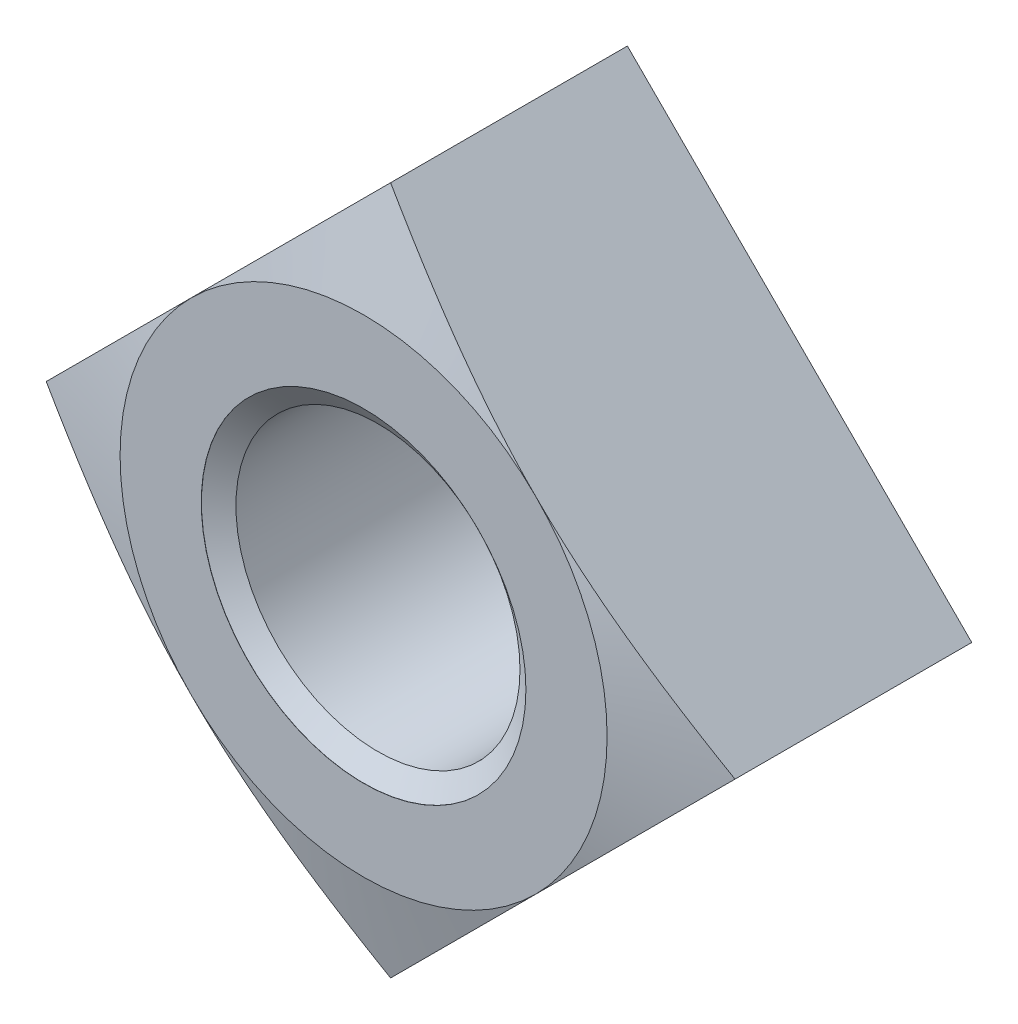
ISO-10303-21;
HEADER;
FILE_DESCRIPTION(('STEP AP214'),'2;1');
FILE_NAME('part.step','',(''),(''),'','','');
FILE_SCHEMA(('AUTOMOTIVE_DESIGN { 1 0 10303 214 1 1 1 1 }'));
ENDSEC;
DATA;
#1=APPLICATION_CONTEXT('core data for automotive mechanical design processes');
#2=APPLICATION_PROTOCOL_DEFINITION('international standard','automotive_design',2000,#1);
#3=PRODUCT_CONTEXT('',#1,'mechanical');
#4=PRODUCT('Part','Part','',(#3));
#5=PRODUCT_RELATED_PRODUCT_CATEGORY('part','',(#4));
#6=PRODUCT_DEFINITION_FORMATION('','',#4);
#7=PRODUCT_DEFINITION_CONTEXT('part definition',#1,'design');
#8=PRODUCT_DEFINITION('design','',#6,#7);
#9=PRODUCT_DEFINITION_SHAPE('','',#8);
#10=(LENGTH_UNIT() NAMED_UNIT(*) SI_UNIT(.MILLI.,.METRE.));
#11=(NAMED_UNIT(*) PLANE_ANGLE_UNIT() SI_UNIT($,.RADIAN.));
#12=(NAMED_UNIT(*) SI_UNIT($,.STERADIAN.) SOLID_ANGLE_UNIT());
#13=UNCERTAINTY_MEASURE_WITH_UNIT(LENGTH_MEASURE(1.E-05),#10,'distance_accuracy_value','');
#14=(GEOMETRIC_REPRESENTATION_CONTEXT(3) GLOBAL_UNCERTAINTY_ASSIGNED_CONTEXT((#13)) GLOBAL_UNIT_ASSIGNED_CONTEXT((#10,
#11,#12)) REPRESENTATION_CONTEXT('',''));
#15=CARTESIAN_POINT('',(0.,0.,0.));
#16=DIRECTION('',(0.,0.,1.));
#17=DIRECTION('',(1.,0.,0.));
#18=AXIS2_PLACEMENT_3D('',#15,#16,#17);
#19=CARTESIAN_POINT('',(0.,0.,-13.));
#20=DIRECTION('',(0.,0.,1.));
#21=DIRECTION('',(1.,0.,0.));
#22=AXIS2_PLACEMENT_3D('',#19,#20,#21);
#23=CYLINDRICAL_SURFACE('',#22,7.);
#24=CARTESIAN_POINT('',(0.,0.,-0.708207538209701));
#25=DIRECTION('',(0.,0.,1.));
#26=DIRECTION('',(1.,0.,0.));
#27=AXIS2_PLACEMENT_3D('',#24,#25,#26);
#28=CIRCLE('',#27,7.);
#29=CARTESIAN_POINT('',(7.,0.,-0.708207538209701));
#30=VERTEX_POINT('',#29);
#31=EDGE_CURVE('E183',#30,#30,#28,.F.);
#32=CARTESIAN_POINT('',(0.,0.,-12.2907924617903));
#33=DIRECTION('',(0.,0.,-1.));
#34=DIRECTION('',(-1.,0.,0.));
#35=AXIS2_PLACEMENT_3D('',#32,#33,#34);
#36=CIRCLE('',#35,7.);
#37=CARTESIAN_POINT('',(7.,0.,-12.2907924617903));
#38=VERTEX_POINT('',#37);
#39=EDGE_CURVE('E46',#38,#38,#36,.F.);
#40=CARTESIAN_POINT('',(7.,0.,-0.708207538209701));
#41=CARTESIAN_POINT('',(7.,0.,-0.828859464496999));
#42=CARTESIAN_POINT('',(7.,0.,-0.949511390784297));
#43=CARTESIAN_POINT('',(7.,0.,-1.19081524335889));
#44=CARTESIAN_POINT('',(7.,0.,-1.31146716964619));
#45=CARTESIAN_POINT('',(7.,0.,-1.55277102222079));
#46=CARTESIAN_POINT('',(7.,0.,-1.67342294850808));
#47=CARTESIAN_POINT('',(7.,0.,-1.91472680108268));
#48=CARTESIAN_POINT('',(7.,0.,-2.03537872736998));
#49=CARTESIAN_POINT('',(7.,0.,-2.27668257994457));
#50=CARTESIAN_POINT('',(7.,0.,-2.39733450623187));
#51=CARTESIAN_POINT('',(7.,0.,-2.63863835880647));
#52=CARTESIAN_POINT('',(7.,0.,-2.75929028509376));
#53=CARTESIAN_POINT('',(7.,0.,-3.00059413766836));
#54=CARTESIAN_POINT('',(7.,0.,-3.12124606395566));
#55=CARTESIAN_POINT('',(7.,0.,-3.36254991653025));
#56=CARTESIAN_POINT('',(7.,0.,-3.48320184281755));
#57=CARTESIAN_POINT('',(7.,0.,-3.72450569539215));
#58=CARTESIAN_POINT('',(7.,0.,-3.84515762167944));
#59=CARTESIAN_POINT('',(7.,0.,-4.08646147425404));
#60=CARTESIAN_POINT('',(7.,0.,-4.20711340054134));
#61=CARTESIAN_POINT('',(7.,0.,-4.44841725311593));
#62=CARTESIAN_POINT('',(7.,0.,-4.56906917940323));
#63=CARTESIAN_POINT('',(7.,0.,-4.81037303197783));
#64=CARTESIAN_POINT('',(7.,0.,-4.93102495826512));
#65=CARTESIAN_POINT('',(7.,0.,-5.17232881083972));
#66=CARTESIAN_POINT('',(7.,0.,-5.29298073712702));
#67=CARTESIAN_POINT('',(7.,0.,-5.53428458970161));
#68=CARTESIAN_POINT('',(7.,0.,-5.65493651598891));
#69=CARTESIAN_POINT('',(7.,0.,-5.89624036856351));
#70=CARTESIAN_POINT('',(7.,0.,-6.0168922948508));
#71=CARTESIAN_POINT('',(7.,0.,-6.2581961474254));
#72=CARTESIAN_POINT('',(7.,0.,-6.3788480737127));
#73=CARTESIAN_POINT('',(7.,0.,-6.62015192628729));
#74=CARTESIAN_POINT('',(7.,0.,-6.74080385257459));
#75=CARTESIAN_POINT('',(7.,0.,-6.98210770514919));
#76=CARTESIAN_POINT('',(7.,0.,-7.10275963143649));
#77=CARTESIAN_POINT('',(7.,0.,-7.34406348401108));
#78=CARTESIAN_POINT('',(7.,0.,-7.46471541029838));
#79=CARTESIAN_POINT('',(7.,0.,-7.70601926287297));
#80=CARTESIAN_POINT('',(7.,0.,-7.82667118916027));
#81=CARTESIAN_POINT('',(7.,0.,-8.06797504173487));
#82=CARTESIAN_POINT('',(7.,0.,-8.18862696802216));
#83=CARTESIAN_POINT('',(7.,0.,-8.42993082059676));
#84=CARTESIAN_POINT('',(7.,0.,-8.55058274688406));
#85=CARTESIAN_POINT('',(7.,0.,-8.79188659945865));
#86=CARTESIAN_POINT('',(7.,0.,-8.91253852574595));
#87=CARTESIAN_POINT('',(7.,0.,-9.15384237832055));
#88=CARTESIAN_POINT('',(7.,0.,-9.27449430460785));
#89=CARTESIAN_POINT('',(7.,0.,-9.51579815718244));
#90=CARTESIAN_POINT('',(7.,0.,-9.63645008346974));
#91=CARTESIAN_POINT('',(7.,0.,-9.87775393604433));
#92=CARTESIAN_POINT('',(7.,0.,-9.99840586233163));
#93=CARTESIAN_POINT('',(7.,0.,-10.2397097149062));
#94=CARTESIAN_POINT('',(7.,0.,-10.3603616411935));
#95=CARTESIAN_POINT('',(7.,0.,-10.6016654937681));
#96=CARTESIAN_POINT('',(7.,0.,-10.7223174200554));
#97=CARTESIAN_POINT('',(7.,0.,-10.96362127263));
#98=CARTESIAN_POINT('',(7.,0.,-11.0842731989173));
#99=CARTESIAN_POINT('',(7.,0.,-11.3255770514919));
#100=CARTESIAN_POINT('',(7.,0.,-11.4462289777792));
#101=CARTESIAN_POINT('',(7.,0.,-11.6875328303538));
#102=CARTESIAN_POINT('',(7.,0.,-11.8081847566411));
#103=CARTESIAN_POINT('',(7.,0.,-12.0494886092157));
#104=CARTESIAN_POINT('',(7.,0.,-12.170140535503));
#105=CARTESIAN_POINT('',(7.,0.,-12.2907924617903));
#106=B_SPLINE_CURVE_WITH_KNOTS('',3,(#40,#41,#42,#43,#44,#45,#46,#47,#48,#49,#50,#51,#52,#53,
#54,#55,#56,#57,#58,#59,#60,#61,#62,#63,#64,#65,#66,#67,#68,#69,#70,#71,#72,#73,#74,#75,#76,#77,
#78,#79,#80,#81,#82,#83,#84,#85,#86,#87,#88,#89,#90,#91,#92,#93,#94,#95,#96,#97,#98,#99,#100,
#101,#102,#103,#104,#105),.UNSPECIFIED.,.F.,.F.,(4,2,2,2,2,2,2,2,2,2,2,2,2,2,2,2,2,2,2,2,2,2,2,
2,2,2,2,2,2,2,2,2,4),(0.,0.361955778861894,0.723911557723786,1.08586733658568,1.44782311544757,
1.80977889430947,2.17173467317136,2.53369045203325,2.89564623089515,3.25760200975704,
3.61955778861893,3.98151356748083,4.34346934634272,4.70542512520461,5.06738090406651,
5.4293366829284,5.79129246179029,6.15324824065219,6.51520401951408,6.87715979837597,
7.23911557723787,7.60107135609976,7.96302713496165,8.32498291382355,8.68693869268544,
9.04889447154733,9.41085025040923,9.77280602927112,10.134761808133,10.4967175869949,
10.8586733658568,11.2206291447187,11.5825849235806),.UNSPECIFIED.);
#107=EDGE_CURVE('BSEAM41',#30,#38,#106,.T.);
#108=ORIENTED_EDGE('',*,*,#31,.F.);
#109=ORIENTED_EDGE('',*,*,#39,.F.);
#110=ORIENTED_EDGE('',*,*,#107,.T.);
#111=ORIENTED_EDGE('',*,*,#107,.F.);
#112=EDGE_LOOP('',(#108,#110,#109,#111));
#113=FACE_BOUND('',#112,.T.);
#114=ADVANCED_FACE('F41',(#113),#23,.F.);
#115=CARTESIAN_POINT('',(0.,-16.9705627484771,-13.));
#116=DIRECTION('',(0.707106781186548,-0.707106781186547,0.));
#117=DIRECTION('',(0.707106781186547,0.707106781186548,0.));
#118=AXIS2_PLACEMENT_3D('',#115,#116,#117);
#119=PLANE('',#118);
#120=DIRECTION('',(0.,0.,1.));
#121=VECTOR('',#120,1.);
#122=CARTESIAN_POINT('',(16.9705627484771,0.,-13.));
#123=LINE('',#122,#121);
#124=CARTESIAN_POINT('',(16.9705627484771,0.,-13.));
#125=VERTEX_POINT('',#124);
#126=CARTESIAN_POINT('',(16.9705627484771,0.,-1.33185827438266));
#127=VERTEX_POINT('',#126);
#128=EDGE_CURVE('E174',#125,#127,#123,.T.);
#129=ORIENTED_EDGE('',*,*,#128,.T.);
#130=CARTESIAN_POINT('',(16.9707627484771,0.000200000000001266,-1.33191186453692));
#131=CARTESIAN_POINT('',(16.7160871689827,-0.254475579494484,-1.26368267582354));
#132=CARTESIAN_POINT('',(16.4612127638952,-0.509349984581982,-1.19691326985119));
#133=CARTESIAN_POINT('',(15.9510162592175,-1.01954648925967,-1.0667933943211));
#134=CARTESIAN_POINT('',(15.6956941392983,-1.27486860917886,-1.00344308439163));
#135=CARTESIAN_POINT('',(15.1844078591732,-1.78615488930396,-0.880626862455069));
#136=CARTESIAN_POINT('',(14.9284433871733,-2.04211936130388,-0.821163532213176));
#137=CARTESIAN_POINT('',(14.4160134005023,-2.55454934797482,-0.706762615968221));
#138=CARTESIAN_POINT('',(14.1595478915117,-2.81101485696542,-0.651824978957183));
#139=CARTESIAN_POINT('',(13.3887812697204,-3.58178147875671,-0.494643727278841));
#140=CARTESIAN_POINT('',(12.8736681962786,-4.09689455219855,-0.400168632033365));
#141=CARTESIAN_POINT('',(11.841395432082,-5.1291673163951,-0.237805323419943));
#142=CARTESIAN_POINT('',(11.3242362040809,-5.64632654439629,-0.169911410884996));
#143=CARTESIAN_POINT('',(10.5512179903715,-6.4193447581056,-0.0926130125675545));
#144=CARTESIAN_POINT('',(10.2959571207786,-6.67460562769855,-0.0710120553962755));
#145=CARTESIAN_POINT('',(9.78514714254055,-7.18541560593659,-0.036117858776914));
#146=CARTESIAN_POINT('',(9.5295980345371,-7.44096471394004,-0.022824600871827));
#147=CARTESIAN_POINT('',(9.01834367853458,-7.95221906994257,-0.0048944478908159));
#148=CARTESIAN_POINT('',(8.76263842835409,-8.20792432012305,-0.000257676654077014));
#149=CARTESIAN_POINT('',(8.25122407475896,-8.71933867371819,0.000236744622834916));
#150=CARTESIAN_POINT('',(7.99551497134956,-8.97504777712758,-0.00390559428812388));
#151=CARTESIAN_POINT('',(7.48449927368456,-9.48606347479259,-0.0208514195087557));
#152=CARTESIAN_POINT('',(7.22919253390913,-9.74137021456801,-0.0336461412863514));
#153=CARTESIAN_POINT('',(6.71886010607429,-10.2517026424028,-0.0675520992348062));
#154=CARTESIAN_POINT('',(6.46383441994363,-10.5067283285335,-0.0886633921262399));
#155=CARTESIAN_POINT('',(5.69934239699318,-11.271220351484,-0.163734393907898));
#156=CARTESIAN_POINT('',(5.19043259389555,-11.7801301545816,-0.229432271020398));
#157=CARTESIAN_POINT('',(4.4868931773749,-12.4836695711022,-0.338449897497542));
#158=CARTESIAN_POINT('',(4.29135123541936,-12.6792115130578,-0.370704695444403));
#159=CARTESIAN_POINT('',(3.90058562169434,-13.0699771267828,-0.438740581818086));
#160=CARTESIAN_POINT('',(3.70536192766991,-13.2652008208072,-0.474521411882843));
#161=CARTESIAN_POINT('',(3.12010609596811,-13.850456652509,-0.586688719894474));
#162=CARTESIAN_POINT('',(2.73053498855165,-14.2400277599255,-0.66789277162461));
#163=CARTESIAN_POINT('',(1.95007997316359,-15.0204827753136,-0.841333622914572));
#164=CARTESIAN_POINT('',(1.55920362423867,-15.4113591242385,-0.933637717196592));
#165=CARTESIAN_POINT('',(0.973762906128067,-15.9967998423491,-1.07850911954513));
#166=CARTESIAN_POINT('',(0.778796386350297,-16.1917663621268,-1.12785940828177));
#167=CARTESIAN_POINT('',(0.389114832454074,-16.5814479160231,-1.2284905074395));
#168=CARTESIAN_POINT('',(0.194399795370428,-16.7761629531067,-1.27977129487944));
#169=CARTESIAN_POINT('',(-0.000199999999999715,-16.9707627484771,-1.33191186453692));
#170=B_SPLINE_CURVE_WITH_KNOTS('',3,(#130,#131,#132,#133,#134,#135,#136,#137,#138,#139,#140,
#141,#142,#143,#144,#145,#146,#147,#148,#149,#150,#151,#152,#153,#154,#155,#156,#157,#158,#159,
#160,#161,#162,#163,#164,#165,#166,#167,#168,#169),.UNSPECIFIED.,.F.,.F.,(4,2,2,2,2,2,2,2,2,2,2,
2,2,2,2,2,2,2,2,4),(0.,1.09971744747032,2.19948619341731,3.29997814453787,4.40045769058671,
6.60381929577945,8.80670822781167,9.89154414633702,10.9763776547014,12.0612266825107,
13.1460743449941,14.2298247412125,15.3135825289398,17.4809772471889,18.3162064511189,
19.1513745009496,20.8219059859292,22.5031307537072,23.3434429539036,24.1837451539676),.UNSPECIFIED.);
#171=CARTESIAN_POINT('',(8.48528137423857,-8.48528137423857,0.));
#172=VERTEX_POINT('',#171);
#173=EDGE_CURVE('E67',#127,#172,#170,.T.);
#174=ORIENTED_EDGE('',*,*,#173,.T.);
#175=CARTESIAN_POINT('',(0.,-16.9705627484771,-1.33185827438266));
#176=VERTEX_POINT('',#175);
#177=EDGE_CURVE('E156',#172,#176,#170,.T.);
#178=ORIENTED_EDGE('',*,*,#177,.T.);
#179=DIRECTION('',(0.,0.,1.));
#180=VECTOR('',#179,1.);
#181=CARTESIAN_POINT('',(0.,-16.9705627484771,-13.));
#182=LINE('',#181,#180);
#183=CARTESIAN_POINT('',(0.,-16.9705627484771,-13.));
#184=VERTEX_POINT('',#183);
#185=EDGE_CURVE('E175',#184,#176,#182,.T.);
#186=ORIENTED_EDGE('',*,*,#185,.F.);
#187=DIRECTION('',(0.707106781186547,0.707106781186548,0.));
#188=VECTOR('',#187,1.);
#189=CARTESIAN_POINT('',(0.,-16.9705627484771,-13.));
#190=LINE('',#189,#188);
#191=EDGE_CURVE('E163',#184,#125,#190,.T.);
#192=ORIENTED_EDGE('',*,*,#191,.T.);
#193=EDGE_LOOP('',(#129,#174,#178,#186,#192));
#194=FACE_BOUND('',#193,.T.);
#195=ADVANCED_FACE('F43',(#194),#119,.T.);
#196=CARTESIAN_POINT('',(-16.9705627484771,0.,-13.));
#197=DIRECTION('',(-0.707106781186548,-0.707106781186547,0.));
#198=DIRECTION('',(0.707106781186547,-0.707106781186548,0.));
#199=AXIS2_PLACEMENT_3D('',#196,#197,#198);
#200=PLANE('',#199);
#201=ORIENTED_EDGE('',*,*,#185,.T.);
#202=CARTESIAN_POINT('',(0.000200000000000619,-16.9707627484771,-1.33191186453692));
#203=CARTESIAN_POINT('',(-0.254475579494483,-16.7160871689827,-1.26368267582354));
#204=CARTESIAN_POINT('',(-0.509349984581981,-16.4612127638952,-1.19691326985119));
#205=CARTESIAN_POINT('',(-1.01954648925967,-15.9510162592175,-1.0667933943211));
#206=CARTESIAN_POINT('',(-1.27486860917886,-15.6956941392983,-1.00344308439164));
#207=CARTESIAN_POINT('',(-1.78615488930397,-15.1844078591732,-0.880626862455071));
#208=CARTESIAN_POINT('',(-2.04211936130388,-14.9284433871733,-0.821163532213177));
#209=CARTESIAN_POINT('',(-2.55454934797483,-14.4160134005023,-0.706762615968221));
#210=CARTESIAN_POINT('',(-2.81101485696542,-14.1595478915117,-0.651824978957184));
#211=CARTESIAN_POINT('',(-3.58178147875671,-13.3887812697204,-0.494643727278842));
#212=CARTESIAN_POINT('',(-4.09689455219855,-12.8736681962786,-0.400168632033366));
#213=CARTESIAN_POINT('',(-5.1291673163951,-11.8413954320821,-0.237805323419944));
#214=CARTESIAN_POINT('',(-5.64632654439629,-11.3242362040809,-0.169911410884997));
#215=CARTESIAN_POINT('',(-6.4193447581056,-10.5512179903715,-0.092613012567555));
#216=CARTESIAN_POINT('',(-6.67460562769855,-10.2959571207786,-0.0710120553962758));
#217=CARTESIAN_POINT('',(-7.18541560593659,-9.78514714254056,-0.0361178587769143));
#218=CARTESIAN_POINT('',(-7.44096471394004,-9.5295980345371,-0.0228246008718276));
#219=CARTESIAN_POINT('',(-7.95221906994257,-9.01834367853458,-0.00489444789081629));
#220=CARTESIAN_POINT('',(-8.20792432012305,-8.7626384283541,-0.000257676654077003));
#221=CARTESIAN_POINT('',(-8.71933867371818,-8.25122407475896,0.000236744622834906));
#222=CARTESIAN_POINT('',(-8.97504777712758,-7.99551497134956,-0.00390559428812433));
#223=CARTESIAN_POINT('',(-9.48606347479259,-7.48449927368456,-0.0208514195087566));
#224=CARTESIAN_POINT('',(-9.74137021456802,-7.22919253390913,-0.0336461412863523));
#225=CARTESIAN_POINT('',(-10.2517026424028,-6.7188601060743,-0.0675520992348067));
#226=CARTESIAN_POINT('',(-10.5067283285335,-6.46383441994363,-0.08866339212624));
#227=CARTESIAN_POINT('',(-11.271220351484,-5.69934239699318,-0.163734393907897));
#228=CARTESIAN_POINT('',(-11.7801301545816,-5.19043259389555,-0.229432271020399));
#229=CARTESIAN_POINT('',(-12.4836695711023,-4.48689317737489,-0.338449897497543));
#230=CARTESIAN_POINT('',(-12.6792115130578,-4.29135123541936,-0.370704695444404));
#231=CARTESIAN_POINT('',(-13.0699771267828,-3.90058562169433,-0.438740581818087));
#232=CARTESIAN_POINT('',(-13.2652008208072,-3.70536192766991,-0.474521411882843));
#233=CARTESIAN_POINT('',(-13.850456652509,-3.12010609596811,-0.586688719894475));
#234=CARTESIAN_POINT('',(-14.2400277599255,-2.73053498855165,-0.667892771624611));
#235=CARTESIAN_POINT('',(-15.0204827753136,-1.95007997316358,-0.841333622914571));
#236=CARTESIAN_POINT('',(-15.4113591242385,-1.55920362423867,-0.933637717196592));
#237=CARTESIAN_POINT('',(-15.9967998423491,-0.973762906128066,-1.07850911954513));
#238=CARTESIAN_POINT('',(-16.1917663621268,-0.778796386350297,-1.12785940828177));
#239=CARTESIAN_POINT('',(-16.5814479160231,-0.389114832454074,-1.2284905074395));
#240=CARTESIAN_POINT('',(-16.7761629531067,-0.194399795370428,-1.27977129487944));
#241=CARTESIAN_POINT('',(-16.9707627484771,0.000200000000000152,-1.33191186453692));
#242=B_SPLINE_CURVE_WITH_KNOTS('',3,(#202,#203,#204,#205,#206,#207,#208,#209,#210,#211,#212,
#213,#214,#215,#216,#217,#218,#219,#220,#221,#222,#223,#224,#225,#226,#227,#228,#229,#230,#231,
#232,#233,#234,#235,#236,#237,#238,#239,#240,#241),.UNSPECIFIED.,.F.,.F.,(4,2,2,2,2,2,2,2,2,2,2,
2,2,2,2,2,2,2,2,4),(0.,1.09971744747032,2.19948619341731,3.29997814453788,4.40045769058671,
6.60381929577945,8.80670822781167,9.89154414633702,10.9763776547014,12.0612266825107,
13.1460743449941,14.2298247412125,15.3135825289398,17.4809772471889,18.3162064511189,
19.1513745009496,20.8219059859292,22.5031307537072,23.3434429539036,24.1837451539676),.UNSPECIFIED.);
#243=CARTESIAN_POINT('',(-8.48528137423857,-8.48528137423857,0.));
#244=VERTEX_POINT('',#243);
#245=EDGE_CURVE('E124',#176,#244,#242,.T.);
#246=ORIENTED_EDGE('',*,*,#245,.T.);
#247=CARTESIAN_POINT('',(-16.9705627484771,0.,-1.33185827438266));
#248=VERTEX_POINT('',#247);
#249=EDGE_CURVE('E110',#244,#248,#242,.T.);
#250=ORIENTED_EDGE('',*,*,#249,.T.);
#251=DIRECTION('',(0.,0.,1.));
#252=VECTOR('',#251,1.);
#253=CARTESIAN_POINT('',(-16.9705627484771,0.,-13.));
#254=LINE('',#253,#252);
#255=CARTESIAN_POINT('',(-16.9705627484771,0.,-13.));
#256=VERTEX_POINT('',#255);
#257=EDGE_CURVE('E123',#256,#248,#254,.T.);
#258=ORIENTED_EDGE('',*,*,#257,.F.);
#259=DIRECTION('',(0.707106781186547,-0.707106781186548,0.));
#260=VECTOR('',#259,1.);
#261=CARTESIAN_POINT('',(-16.9705627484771,0.,-13.));
#262=LINE('',#261,#260);
#263=EDGE_CURVE('E171',#256,#184,#262,.T.);
#264=ORIENTED_EDGE('',*,*,#263,.T.);
#265=EDGE_LOOP('',(#201,#246,#250,#258,#264));
#266=FACE_BOUND('',#265,.T.);
#267=ADVANCED_FACE('F220',(#266),#200,.T.);
#268=CARTESIAN_POINT('',(0.,16.9705627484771,-13.));
#269=DIRECTION('',(-0.707106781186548,0.707106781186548,0.));
#270=DIRECTION('',(-0.707106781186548,-0.707106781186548,0.));
#271=AXIS2_PLACEMENT_3D('',#268,#269,#270);
#272=PLANE('',#271);
#273=ORIENTED_EDGE('',*,*,#257,.T.);
#274=CARTESIAN_POINT('',(-16.9707627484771,-0.000199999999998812,-1.33191186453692));
#275=CARTESIAN_POINT('',(-16.7160871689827,0.254475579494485,-1.26368267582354));
#276=CARTESIAN_POINT('',(-16.4612127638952,0.509349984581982,-1.19691326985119));
#277=CARTESIAN_POINT('',(-15.9510162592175,1.01954648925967,-1.0667933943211));
#278=CARTESIAN_POINT('',(-15.6956941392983,1.27486860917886,-1.00344308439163));
#279=CARTESIAN_POINT('',(-15.1844078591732,1.78615488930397,-0.88062686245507));
#280=CARTESIAN_POINT('',(-14.9284433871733,2.04211936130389,-0.821163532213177));
#281=CARTESIAN_POINT('',(-14.4160134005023,2.55454934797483,-0.706762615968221));
#282=CARTESIAN_POINT('',(-14.1595478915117,2.81101485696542,-0.651824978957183));
#283=CARTESIAN_POINT('',(-13.3887812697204,3.58178147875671,-0.494643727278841));
#284=CARTESIAN_POINT('',(-12.8736681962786,4.09689455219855,-0.400168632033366));
#285=CARTESIAN_POINT('',(-11.841395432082,5.1291673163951,-0.237805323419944));
#286=CARTESIAN_POINT('',(-11.3242362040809,5.64632654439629,-0.169911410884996));
#287=CARTESIAN_POINT('',(-10.5512179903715,6.4193447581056,-0.0926130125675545));
#288=CARTESIAN_POINT('',(-10.2959571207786,6.67460562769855,-0.0710120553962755));
#289=CARTESIAN_POINT('',(-9.78514714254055,7.18541560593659,-0.0361178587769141));
#290=CARTESIAN_POINT('',(-9.5295980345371,7.44096471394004,-0.0228246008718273));
#291=CARTESIAN_POINT('',(-9.01834367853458,7.95221906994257,-0.00489444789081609));
#292=CARTESIAN_POINT('',(-8.76263842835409,8.20792432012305,-0.000257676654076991));
#293=CARTESIAN_POINT('',(-8.25122407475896,8.71933867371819,0.000236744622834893));
#294=CARTESIAN_POINT('',(-7.99551497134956,8.97504777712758,-0.00390559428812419));
#295=CARTESIAN_POINT('',(-7.48449927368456,9.48606347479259,-0.0208514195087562));
#296=CARTESIAN_POINT('',(-7.22919253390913,9.74137021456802,-0.0336461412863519));
#297=CARTESIAN_POINT('',(-6.71886010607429,10.2517026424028,-0.0675520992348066));
#298=CARTESIAN_POINT('',(-6.46383441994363,10.5067283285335,-0.0886633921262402));
#299=CARTESIAN_POINT('',(-5.69934239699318,11.271220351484,-0.163734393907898));
#300=CARTESIAN_POINT('',(-5.19043259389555,11.7801301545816,-0.229432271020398));
#301=CARTESIAN_POINT('',(-4.4868931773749,12.4836695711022,-0.338449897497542));
#302=CARTESIAN_POINT('',(-4.29135123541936,12.6792115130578,-0.370704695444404));
#303=CARTESIAN_POINT('',(-3.90058562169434,13.0699771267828,-0.438740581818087));
#304=CARTESIAN_POINT('',(-3.70536192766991,13.2652008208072,-0.474521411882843));
#305=CARTESIAN_POINT('',(-3.12010609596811,13.850456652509,-0.586688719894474));
#306=CARTESIAN_POINT('',(-2.73053498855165,14.2400277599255,-0.66789277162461));
#307=CARTESIAN_POINT('',(-1.95007997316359,15.0204827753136,-0.841333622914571));
#308=CARTESIAN_POINT('',(-1.55920362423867,15.4113591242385,-0.933637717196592));
#309=CARTESIAN_POINT('',(-0.973762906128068,15.9967998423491,-1.07850911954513));
#310=CARTESIAN_POINT('',(-0.778796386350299,16.1917663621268,-1.12785940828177));
#311=CARTESIAN_POINT('',(-0.389114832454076,16.5814479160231,-1.2284905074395));
#312=CARTESIAN_POINT('',(-0.19439979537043,16.7761629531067,-1.27977129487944));
#313=CARTESIAN_POINT('',(0.000199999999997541,16.9707627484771,-1.33191186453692));
#314=B_SPLINE_CURVE_WITH_KNOTS('',3,(#274,#275,#276,#277,#278,#279,#280,#281,#282,#283,#284,
#285,#286,#287,#288,#289,#290,#291,#292,#293,#294,#295,#296,#297,#298,#299,#300,#301,#302,#303,
#304,#305,#306,#307,#308,#309,#310,#311,#312,#313),.UNSPECIFIED.,.F.,.F.,(4,2,2,2,2,2,2,2,2,2,2,
2,2,2,2,2,2,2,2,4),(0.,1.09971744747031,2.19948619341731,3.29997814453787,4.40045769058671,
6.60381929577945,8.80670822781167,9.89154414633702,10.9763776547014,12.0612266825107,
13.1460743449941,14.2298247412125,15.3135825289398,17.4809772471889,18.3162064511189,
19.1513745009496,20.8219059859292,22.5031307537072,23.3434429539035,24.1837451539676),.UNSPECIFIED.);
#315=CARTESIAN_POINT('',(-8.48528137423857,8.48528137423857,0.));
#316=VERTEX_POINT('',#315);
#317=EDGE_CURVE('E105',#248,#316,#314,.T.);
#318=ORIENTED_EDGE('',*,*,#317,.T.);
#319=CARTESIAN_POINT('',(0.,16.9705627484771,-1.33185827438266));
#320=VERTEX_POINT('',#319);
#321=EDGE_CURVE('E97',#316,#320,#314,.T.);
#322=ORIENTED_EDGE('',*,*,#321,.T.);
#323=DIRECTION('',(0.,0.,1.));
#324=VECTOR('',#323,1.);
#325=CARTESIAN_POINT('',(0.,16.9705627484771,-13.));
#326=LINE('',#325,#324);
#327=CARTESIAN_POINT('',(0.,16.9705627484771,-13.));
#328=VERTEX_POINT('',#327);
#329=EDGE_CURVE('E179',#328,#320,#326,.T.);
#330=ORIENTED_EDGE('',*,*,#329,.F.);
#331=DIRECTION('',(-0.707106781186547,-0.707106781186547,0.));
#332=VECTOR('',#331,1.);
#333=CARTESIAN_POINT('',(0.,16.9705627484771,-13.));
#334=LINE('',#333,#332);
#335=EDGE_CURVE('E169',#328,#256,#334,.T.);
#336=ORIENTED_EDGE('',*,*,#335,.T.);
#337=EDGE_LOOP('',(#273,#318,#322,#330,#336));
#338=FACE_BOUND('',#337,.T.);
#339=ADVANCED_FACE('F121',(#338),#272,.T.);
#340=CARTESIAN_POINT('',(16.9705627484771,0.,-13.));
#341=DIRECTION('',(0.707106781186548,0.707106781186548,0.));
#342=DIRECTION('',(-0.707106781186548,0.707106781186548,0.));
#343=AXIS2_PLACEMENT_3D('',#340,#341,#342);
#344=PLANE('',#343);
#345=ORIENTED_EDGE('',*,*,#329,.T.);
#346=CARTESIAN_POINT('',(-0.000200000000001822,16.9707627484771,-1.33191186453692));
#347=CARTESIAN_POINT('',(0.254475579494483,16.7160871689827,-1.26368267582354));
#348=CARTESIAN_POINT('',(0.50934998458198,16.4612127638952,-1.19691326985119));
#349=CARTESIAN_POINT('',(1.01954648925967,15.9510162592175,-1.0667933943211));
#350=CARTESIAN_POINT('',(1.27486860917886,15.6956941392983,-1.00344308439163));
#351=CARTESIAN_POINT('',(1.78615488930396,15.1844078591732,-0.880626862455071));
#352=CARTESIAN_POINT('',(2.04211936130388,14.9284433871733,-0.821163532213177));
#353=CARTESIAN_POINT('',(2.55454934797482,14.4160134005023,-0.706762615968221));
#354=CARTESIAN_POINT('',(2.81101485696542,14.1595478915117,-0.651824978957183));
#355=CARTESIAN_POINT('',(3.5817814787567,13.3887812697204,-0.49464372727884));
#356=CARTESIAN_POINT('',(4.09689455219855,12.8736681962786,-0.400168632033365));
#357=CARTESIAN_POINT('',(5.1291673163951,11.841395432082,-0.237805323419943));
#358=CARTESIAN_POINT('',(5.64632654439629,11.3242362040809,-0.169911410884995));
#359=CARTESIAN_POINT('',(6.4193447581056,10.5512179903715,-0.0926130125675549));
#360=CARTESIAN_POINT('',(6.67460562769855,10.2959571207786,-0.0710120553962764));
#361=CARTESIAN_POINT('',(7.18541560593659,9.78514714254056,-0.0361178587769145));
#362=CARTESIAN_POINT('',(7.44096471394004,9.5295980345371,-0.0228246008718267));
#363=CARTESIAN_POINT('',(7.95221906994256,9.01834367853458,-0.00489444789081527));
#364=CARTESIAN_POINT('',(8.20792432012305,8.7626384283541,-0.000257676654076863));
#365=CARTESIAN_POINT('',(8.71933867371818,8.25122407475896,0.000236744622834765));
#366=CARTESIAN_POINT('',(8.97504777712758,7.99551497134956,-0.00390559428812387));
#367=CARTESIAN_POINT('',(9.48606347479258,7.48449927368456,-0.0208514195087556));
#368=CARTESIAN_POINT('',(9.74137021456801,7.22919253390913,-0.0336461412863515));
#369=CARTESIAN_POINT('',(10.2517026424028,6.7188601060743,-0.0675520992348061));
#370=CARTESIAN_POINT('',(10.5067283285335,6.46383441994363,-0.0886633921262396));
#371=CARTESIAN_POINT('',(11.271220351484,5.69934239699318,-0.163734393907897));
#372=CARTESIAN_POINT('',(11.7801301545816,5.19043259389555,-0.229432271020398));
#373=CARTESIAN_POINT('',(12.4836695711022,4.4868931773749,-0.338449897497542));
#374=CARTESIAN_POINT('',(12.6792115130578,4.29135123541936,-0.370704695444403));
#375=CARTESIAN_POINT('',(13.0699771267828,3.90058562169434,-0.438740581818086));
#376=CARTESIAN_POINT('',(13.2652008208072,3.70536192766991,-0.474521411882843));
#377=CARTESIAN_POINT('',(13.850456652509,3.12010609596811,-0.586688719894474));
#378=CARTESIAN_POINT('',(14.2400277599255,2.73053498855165,-0.66789277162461));
#379=CARTESIAN_POINT('',(15.0204827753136,1.95007997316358,-0.841333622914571));
#380=CARTESIAN_POINT('',(15.4113591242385,1.55920362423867,-0.933637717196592));
#381=CARTESIAN_POINT('',(15.9967998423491,0.973762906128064,-1.07850911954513));
#382=CARTESIAN_POINT('',(16.1917663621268,0.778796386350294,-1.12785940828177));
#383=CARTESIAN_POINT('',(16.5814479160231,0.389114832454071,-1.2284905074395));
#384=CARTESIAN_POINT('',(16.7761629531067,0.194399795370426,-1.27977129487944));
#385=CARTESIAN_POINT('',(16.9707627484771,-0.000199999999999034,-1.33191186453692));
#386=B_SPLINE_CURVE_WITH_KNOTS('',3,(#346,#347,#348,#349,#350,#351,#352,#353,#354,#355,#356,
#357,#358,#359,#360,#361,#362,#363,#364,#365,#366,#367,#368,#369,#370,#371,#372,#373,#374,#375,
#376,#377,#378,#379,#380,#381,#382,#383,#384,#385),.UNSPECIFIED.,.F.,.F.,(4,2,2,2,2,2,2,2,2,2,2,
2,2,2,2,2,2,2,2,4),(0.,1.09971744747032,2.1994861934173,3.29997814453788,4.40045769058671,
6.60381929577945,8.80670822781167,9.89154414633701,10.9763776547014,12.0612266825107,
13.1460743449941,14.2298247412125,15.3135825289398,17.4809772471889,18.3162064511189,
19.1513745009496,20.8219059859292,22.5031307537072,23.3434429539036,24.1837451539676),.UNSPECIFIED.);
#387=CARTESIAN_POINT('',(8.48528137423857,8.48528137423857,0.));
#388=VERTEX_POINT('',#387);
#389=EDGE_CURVE('E101',#320,#388,#386,.T.);
#390=ORIENTED_EDGE('',*,*,#389,.T.);
#391=EDGE_CURVE('E117',#388,#127,#386,.T.);
#392=ORIENTED_EDGE('',*,*,#391,.T.);
#393=ORIENTED_EDGE('',*,*,#128,.F.);
#394=DIRECTION('',(-0.707106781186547,0.707106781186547,0.));
#395=VECTOR('',#394,1.);
#396=CARTESIAN_POINT('',(16.9705627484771,0.,-13.));
#397=LINE('',#396,#395);
#398=EDGE_CURVE('E166',#125,#328,#397,.T.);
#399=ORIENTED_EDGE('',*,*,#398,.T.);
#400=EDGE_LOOP('',(#345,#390,#392,#393,#399));
#401=FACE_BOUND('',#400,.T.);
#402=ADVANCED_FACE('F233',(#401),#344,.T.);
#403=CARTESIAN_POINT('',(16.9705627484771,0.,0.));
#404=DIRECTION('',(0.,0.,1.));
#405=DIRECTION('',(1.,0.,0.));
#406=AXIS2_PLACEMENT_3D('',#403,#404,#405);
#407=PLANE('',#406);
#408=CARTESIAN_POINT('',(0.,0.,0.));
#409=DIRECTION('',(0.,0.,1.));
#410=DIRECTION('',(1.,0.,0.));
#411=AXIS2_PLACEMENT_3D('',#408,#409,#410);
#412=CIRCLE('',#411,8.);
#413=CARTESIAN_POINT('',(8.,0.,0.));
#414=VERTEX_POINT('',#413);
#415=EDGE_CURVE('E118',#414,#414,#412,.F.);
#416=ORIENTED_EDGE('',*,*,#415,.T.);
#417=EDGE_LOOP('',(#416));
#418=FACE_BOUND('',#417,.T.);
#419=CARTESIAN_POINT('',(0.,0.,0.));
#420=DIRECTION('',(0.,0.,1.));
#421=DIRECTION('',(1.,0.,0.));
#422=AXIS2_PLACEMENT_3D('',#419,#420,#421);
#423=CIRCLE('',#422,12.);
#424=EDGE_CURVE('E53',#172,#388,#423,.T.);
#425=ORIENTED_EDGE('',*,*,#424,.T.);
#426=CARTESIAN_POINT('',(0.,0.,0.));
#427=DIRECTION('',(0.,0.,1.));
#428=DIRECTION('',(1.,0.,0.));
#429=AXIS2_PLACEMENT_3D('',#426,#427,#428);
#430=CIRCLE('',#429,12.);
#431=EDGE_CURVE('E60',#388,#316,#430,.T.);
#432=ORIENTED_EDGE('',*,*,#431,.T.);
#433=EDGE_CURVE('E11',#316,#244,#423,.T.);
#434=ORIENTED_EDGE('',*,*,#433,.T.);
#435=EDGE_CURVE('E51',#244,#172,#423,.T.);
#436=ORIENTED_EDGE('',*,*,#435,.T.);
#437=EDGE_LOOP('',(#425,#432,#434,#436));
#438=FACE_BOUND('',#437,.T.);
#439=ADVANCED_FACE('F116',(#418,#438),#407,.T.);
#440=CARTESIAN_POINT('',(16.9705627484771,0.,-13.));
#441=DIRECTION('',(0.,0.,1.));
#442=DIRECTION('',(1.,0.,0.));
#443=AXIS2_PLACEMENT_3D('',#440,#441,#442);
#444=PLANE('',#443);
#445=CARTESIAN_POINT('',(0.,0.,-13.));
#446=DIRECTION('',(0.,0.,1.));
#447=DIRECTION('',(1.,0.,0.));
#448=AXIS2_PLACEMENT_3D('',#445,#446,#447);
#449=CIRCLE('',#448,8.);
#450=CARTESIAN_POINT('',(8.,0.,-13.));
#451=VERTEX_POINT('',#450);
#452=EDGE_CURVE('E188',#451,#451,#449,.F.);
#453=ORIENTED_EDGE('',*,*,#452,.F.);
#454=EDGE_LOOP('',(#453));
#455=FACE_BOUND('',#454,.T.);
#456=ORIENTED_EDGE('',*,*,#191,.F.);
#457=ORIENTED_EDGE('',*,*,#263,.F.);
#458=ORIENTED_EDGE('',*,*,#335,.F.);
#459=ORIENTED_EDGE('',*,*,#398,.F.);
#460=EDGE_LOOP('',(#456,#457,#458,#459));
#461=FACE_BOUND('',#460,.T.);
#462=ADVANCED_FACE('F236',(#455,#461),#444,.F.);
#463=CARTESIAN_POINT('',(0.,0.,0.));
#464=DIRECTION('',(0.,0.,-1.));
#465=DIRECTION('',(-1.,0.,0.));
#466=AXIS2_PLACEMENT_3D('',#463,#464,#465);
#467=CONICAL_SURFACE('',#466,12.,1.30899693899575);
#468=ORIENTED_EDGE('',*,*,#391,.F.);
#469=ORIENTED_EDGE('',*,*,#424,.F.);
#470=ORIENTED_EDGE('',*,*,#173,.F.);
#471=EDGE_LOOP('',(#468,#469,#470));
#472=FACE_BOUND('',#471,.T.);
#473=ADVANCED_FACE('F149',(#472),#467,.T.);
#474=ORIENTED_EDGE('',*,*,#435,.F.);
#475=ORIENTED_EDGE('',*,*,#245,.F.);
#476=ORIENTED_EDGE('',*,*,#177,.F.);
#477=EDGE_LOOP('',(#474,#475,#476));
#478=FACE_BOUND('',#477,.T.);
#479=ADVANCED_FACE('F239',(#478),#467,.T.);
#480=ORIENTED_EDGE('',*,*,#433,.F.);
#481=ORIENTED_EDGE('',*,*,#317,.F.);
#482=ORIENTED_EDGE('',*,*,#249,.F.);
#483=EDGE_LOOP('',(#480,#481,#482));
#484=FACE_BOUND('',#483,.T.);
#485=ADVANCED_FACE('F108',(#484),#467,.T.);
#486=ORIENTED_EDGE('',*,*,#431,.F.);
#487=ORIENTED_EDGE('',*,*,#389,.F.);
#488=ORIENTED_EDGE('',*,*,#321,.F.);
#489=EDGE_LOOP('',(#486,#487,#488));
#490=FACE_BOUND('',#489,.T.);
#491=ADVANCED_FACE('F99',(#490),#467,.T.);
#492=CARTESIAN_POINT('',(0.,0.,-0.778228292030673));
#493=DIRECTION('',(0.,0.,1.));
#494=DIRECTION('',(1.,0.,0.));
#495=AXIS2_PLACEMENT_3D('',#492,#493,#494);
#496=CONICAL_SURFACE('',#495,6.9,0.959931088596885);
#497=CARTESIAN_POINT('',(0.,0.,-0.00799999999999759));
#498=DIRECTION('',(0.,0.,1.));
#499=DIRECTION('',(1.,0.,0.));
#500=AXIS2_PLACEMENT_3D('',#497,#498,#499);
#501=CIRCLE('',#500,8.);
#502=CARTESIAN_POINT('',(8.,0.,-0.00799999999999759));
#503=VERTEX_POINT('',#502);
#504=EDGE_CURVE('E186',#503,#503,#501,.T.);
#505=ORIENTED_EDGE('',*,*,#504,.T.);
#506=EDGE_LOOP('',(#505));
#507=FACE_BOUND('',#506,.T.);
#508=ORIENTED_EDGE('',*,*,#31,.T.);
#509=EDGE_LOOP('',(#508));
#510=FACE_BOUND('',#509,.T.);
#511=ADVANCED_FACE('F148',(#507,#510),#496,.F.);
#512=CARTESIAN_POINT('',(0.,0.,-25.0375057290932));
#513=DIRECTION('',(0.,0.,1.));
#514=DIRECTION('',(1.,0.,0.));
#515=AXIS2_PLACEMENT_3D('',#512,#513,#514);
#516=CYLINDRICAL_SURFACE('',#515,8.);
#517=ORIENTED_EDGE('',*,*,#415,.F.);
#518=EDGE_LOOP('',(#517));
#519=FACE_BOUND('',#518,.T.);
#520=ORIENTED_EDGE('',*,*,#504,.F.);
#521=EDGE_LOOP('',(#520));
#522=FACE_BOUND('',#521,.T.);
#523=ADVANCED_FACE('F150',(#519,#522),#516,.F.);
#524=CARTESIAN_POINT('',(0.,0.,-12.991));
#525=DIRECTION('',(0.,0.,-1.));
#526=DIRECTION('',(-1.,0.,0.));
#527=AXIS2_PLACEMENT_3D('',#524,#525,#526);
#528=CONICAL_SURFACE('',#527,8.,0.95993108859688);
#529=CARTESIAN_POINT('',(0.,0.,-12.991));
#530=DIRECTION('',(0.,0.,1.));
#531=DIRECTION('',(1.,0.,0.));
#532=AXIS2_PLACEMENT_3D('',#529,#530,#531);
#533=CIRCLE('',#532,8.);
#534=CARTESIAN_POINT('',(8.,0.,-12.991));
#535=VERTEX_POINT('',#534);
#536=EDGE_CURVE('E190',#535,#535,#533,.T.);
#537=ORIENTED_EDGE('',*,*,#536,.F.);
#538=EDGE_LOOP('',(#537));
#539=FACE_BOUND('',#538,.T.);
#540=ORIENTED_EDGE('',*,*,#39,.T.);
#541=EDGE_LOOP('',(#540));
#542=FACE_BOUND('',#541,.T.);
#543=ADVANCED_FACE('F205',(#539,#542),#528,.F.);
#544=CARTESIAN_POINT('',(0.,0.,-25.0375057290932));
#545=DIRECTION('',(0.,0.,1.));
#546=DIRECTION('',(1.,0.,0.));
#547=AXIS2_PLACEMENT_3D('',#544,#545,#546);
#548=CYLINDRICAL_SURFACE('',#547,8.);
#549=ORIENTED_EDGE('',*,*,#536,.T.);
#550=EDGE_LOOP('',(#549));
#551=FACE_BOUND('',#550,.T.);
#552=ORIENTED_EDGE('',*,*,#452,.T.);
#553=EDGE_LOOP('',(#552));
#554=FACE_BOUND('',#553,.T.);
#555=ADVANCED_FACE('F211',(#551,#554),#548,.F.);
#556=CLOSED_SHELL('',(#114,#195,#267,#339,#402,#439,#462,#473,#479,#485,#491,#511,#523,#543,#555));
#557=MANIFOLD_SOLID_BREP('B2',#556);
#558=ADVANCED_BREP_SHAPE_REPRESENTATION('',(#18,#557),#14);
#559=SHAPE_DEFINITION_REPRESENTATION(#9,#558);
ENDSEC;
END-ISO-10303-21;
